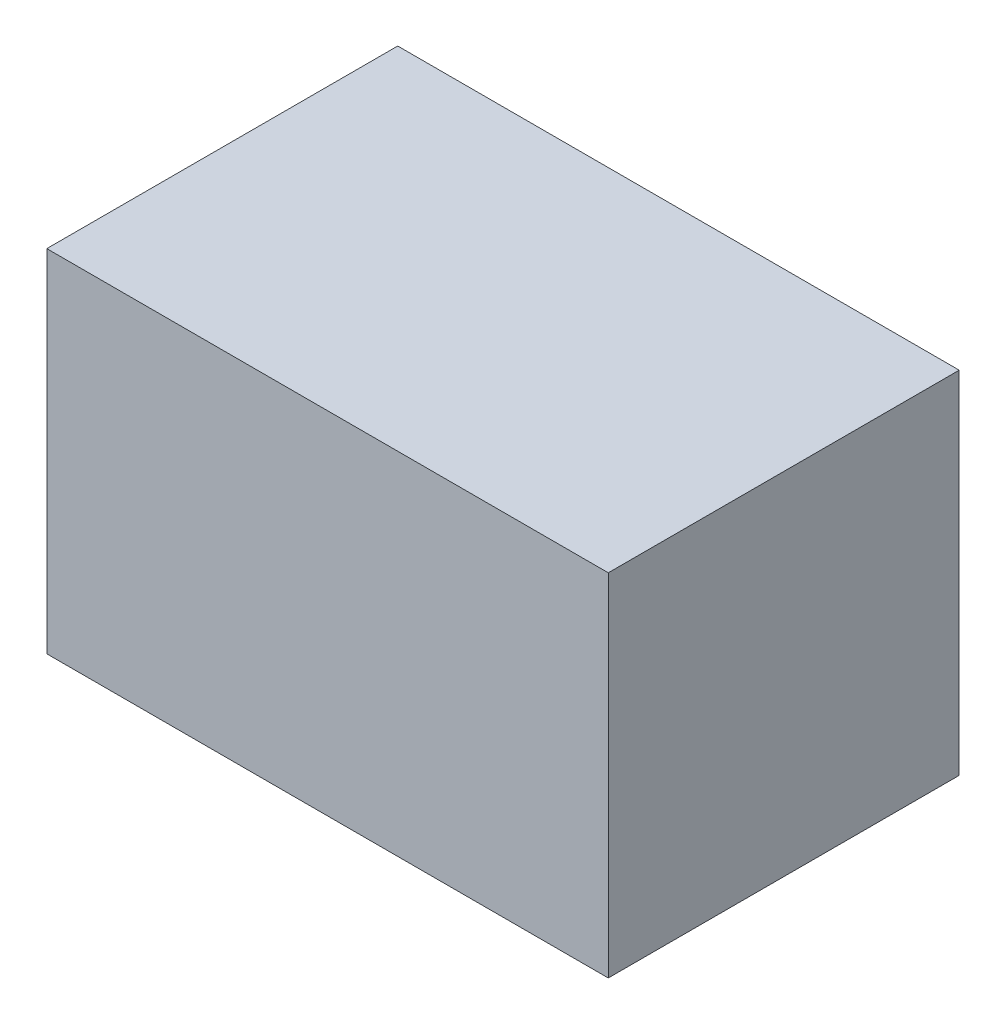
from build123d import *

# Parameters (mm, degrees)
SKETCH1_W           = 80
SKETCH1_H           = 50
BOSS_EXTRUDE1_DEPTH = 50
SHELL1_T            = 5
BOSS_EXTRUDE2_DEPTH = 5


with BuildPart() as part:
    # Sketch1 → Boss-Extrude1 (new body)
    with BuildSketch(Plane(origin=(0, 0, 0), x_dir=(1, 0, 0), z_dir=(0, 1, 0))):
        Rectangle(SKETCH1_W, SKETCH1_H)
    extrude(amount=BOSS_EXTRUDE1_DEPTH)

    # Shell1 (no face opened: a closed hollow body)
    add(offset(amount=-SHELL1_T, mode=Mode.PRIVATE), mode=Mode.SUBTRACT)

    # Sketch2 → Boss-Extrude2 (add)
    with BuildSketch(Plane(origin=(0, 5, 0), x_dir=(1, 0, 0), z_dir=(0, 1, 0))):
        with BuildLine():
            Line((-20, 13), (20, 13))
            ThreePointArc((20, 13), (22, 11), (20, 9))
            Line((20, 9), (-20, 9))
            ThreePointArc((-20, 9), (-22, 11), (-20, 13))
        make_face()
        with BuildLine():
            Line((-20, -9), (20, -9))
            ThreePointArc((20, -9), (22, -11), (20, -13))
            Line((20, -13), (-20, -13))
            ThreePointArc((-20, -13), (-22, -11), (-20, -9))
        make_face()
    extrude(amount=BOSS_EXTRUDE2_DEPTH)


solid = part.part
